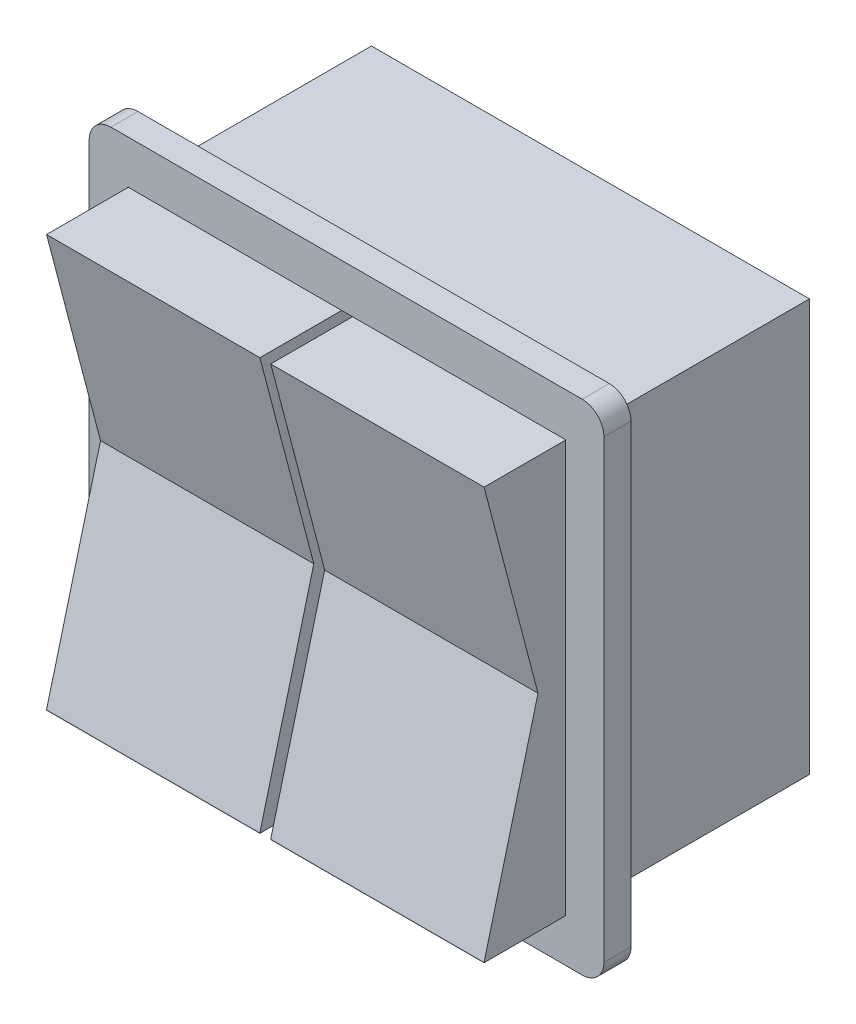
from build123d import *

# Parameters (mm, degrees)
SKETCH1_W             = 51.308
SKETCH1_H             = 48.26
BOSS_EXTRUDE1_DEPTH   = 25.4
SKETCH2_W             = 51.308
SKETCH2_H             = 48.26
BOSS_EXTRUDE2_DEPTH   = 3.175
SKETCH3_W             = 24.992359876
SKETCH3_H             = 48.26
BOSS_EXTRUDE5_DEPTH   = 12.7
BOSS_EXTRUDE5_2_DEPTH = 12.7
CUT_EXTRUDE1_DEPTH    = 254


with BuildPart() as part:
    # Sketch1 → Boss-Extrude1 (new body)
    with BuildSketch(Plane.XY):
        Rectangle(SKETCH1_W, SKETCH1_H)
    extrude(amount=BOSS_EXTRUDE1_DEPTH)


with BuildPart() as body_2:
    # Sketch2 → Boss-Extrude2 (new body)
    with BuildSketch(Plane.XY.offset(25.4)):
        with BuildLine():
            Line((-27.6098, -29.21), (27.6098, -29.21))
            ThreePointArc((27.6098, -29.21), (29.405851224, -28.466051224), (30.1498, -26.67))
            Line((30.1498, -26.67), (30.1498, 26.67))
            ThreePointArc((30.1498, 26.67), (29.405851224, 28.466051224), (27.6098, 29.21))
            Line((27.6098, 29.21), (-27.6098, 29.21))
            ThreePointArc((-27.6098, 29.21), (-29.405851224, 28.466051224), (-30.1498, 26.67))
            Line((-30.1498, 26.67), (-30.1498, -26.67))
            ThreePointArc((-30.1498, -26.67), (-29.405851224, -28.466051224), (-27.6098, -29.21))
        make_face()
        Rectangle(SKETCH2_W, SKETCH2_H, mode=Mode.SUBTRACT)
    extrude(amount=BOSS_EXTRUDE2_DEPTH)


with BuildPart() as body_3:
    # Sketch3 → Boss-Extrude5 (new body)
    with BuildSketch(Plane.XY.offset(25.4)):
        with Locations((13.14172438, -0.057993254)):
            Rectangle(SKETCH3_W, SKETCH3_H)
    extrude(amount=BOSS_EXTRUDE5_DEPTH)


with BuildPart() as body_4:
    # Sketch3 → Boss-Extrude5 2 (new body)
    with BuildSketch(Plane.XY.offset(25.4)):
        with Locations((-13.122495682, -0.057993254)):
            Rectangle(SKETCH3_W, SKETCH3_H)
    extrude(amount=BOSS_EXTRUDE5_2_DEPTH)


with BuildPart() as cut_extrude1_tool:
    # Sketch4 → Cut-Extrude1 (new body)
    with BuildSketch(Plane.ZY.offset(25.61867562)):
        Polygon((38.1, 24.072006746), (38.1, -24.13), (31.784037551, 0), align=None)
    extrude(amount=-CUT_EXTRUDE1_DEPTH)


with BuildPart() as body_3_1:
    add(body_3.part)

    # Cut-Extrude1: cut by cut_extrude1_tool
    add(cut_extrude1_tool.part, mode=Mode.SUBTRACT)


with BuildPart() as body_4_1:
    add(body_4.part)

    # Cut-Extrude1: cut by cut_extrude1_tool
    add(cut_extrude1_tool.part, mode=Mode.SUBTRACT)


solid = Compound([part.part, body_2.part, body_3_1.part, body_4_1.part])
